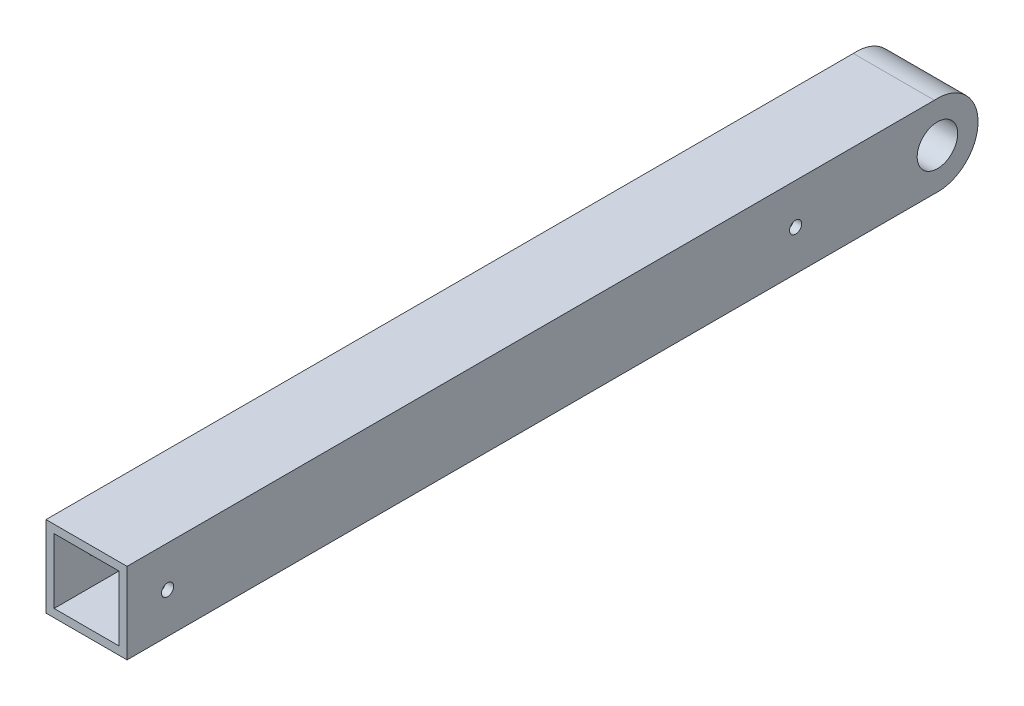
from build123d import *

# Parameters (mm, degrees)
ESQUISSE1_W             = 20
ESQUISSE1_H             = 20
BOSS_EXTRU_1_DEPTH      = 200
ESQUISSE2_R             = 10.028670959
BOSS_EXTRU_2_DEPTH      = 20
ESQUISSE3_R             = 5
ENL_V_MAT_EXTRU_1_DEPTH = 202.99293963
ESQUISSE4_W             = 16
ESQUISSE4_H             = 16
ENL_V_MAT_EXTRU_2_DEPTH = 170
ESQUISSE5_R             = 1.5
ENL_V_MAT_EXTRU_3_DEPTH = 202.99293963
ESQUISSE6_R             = 1.5
ENL_V_MAT_EXTRU_4_DEPTH = 202.99293963


with BuildPart() as part:
    # Esquisse1 → Boss.-Extru.1 (new body)
    with BuildSketch(Plane.XY):
        with Locations((-10, 10)):
            Rectangle(ESQUISSE1_W, ESQUISSE1_H)
    extrude(amount=BOSS_EXTRU_1_DEPTH)

    # Esquisse2 → Boss.-Extru.2 (add)
    with BuildSketch(Plane(origin=(0, 0, 0), x_dir=(0, 0, -1), z_dir=(1, 0, 0))):
        with Locations((0, 10)):
            Circle(ESQUISSE2_R)
    extrude(amount=-BOSS_EXTRU_2_DEPTH)

    # Esquisse3 → Enl_v. mat.-Extru.1 (cut, through all)
    with BuildSketch(Plane(origin=(0, 0, 0), x_dir=(0, 0, -1), z_dir=(1, 0, 0))):
        with Locations(Location((0, 10, 0), (0, 0, 90))):
            Circle(ESQUISSE3_R)
    extrude(amount=-ENL_V_MAT_EXTRU_1_DEPTH, mode=Mode.SUBTRACT)

    # Esquisse4 → Enl_v. mat.-Extru.2 (cut)
    with BuildSketch(Plane.XY.offset(200)):
        with Locations((-10, 10)):
            Rectangle(ESQUISSE4_W, ESQUISSE4_H)
    extrude(amount=-ENL_V_MAT_EXTRU_2_DEPTH, mode=Mode.SUBTRACT)

    # Esquisse5 → Enl_v. mat.-Extru.3 (cut, through all)
    with BuildSketch(Plane(origin=(0, 0, 0), x_dir=(0, 0, -1), z_dir=(1, 0, 0))):
        with Locations(Location((-35, 10, 0), (0, 0, 90))):
            Circle(ESQUISSE5_R)
    extrude(amount=-ENL_V_MAT_EXTRU_3_DEPTH, mode=Mode.SUBTRACT)

    # Esquisse6 → Enl_v. mat.-Extru.4 (cut, through all)
    with BuildSketch(Plane(origin=(0, 0, 0), x_dir=(0, 0, -1), z_dir=(1, 0, 0))):
        with Locations(Location((-190, 10, 0), (0, 0, 90))):
            Circle(ESQUISSE6_R)
    extrude(amount=-ENL_V_MAT_EXTRU_4_DEPTH, mode=Mode.SUBTRACT)


solid = part.part
